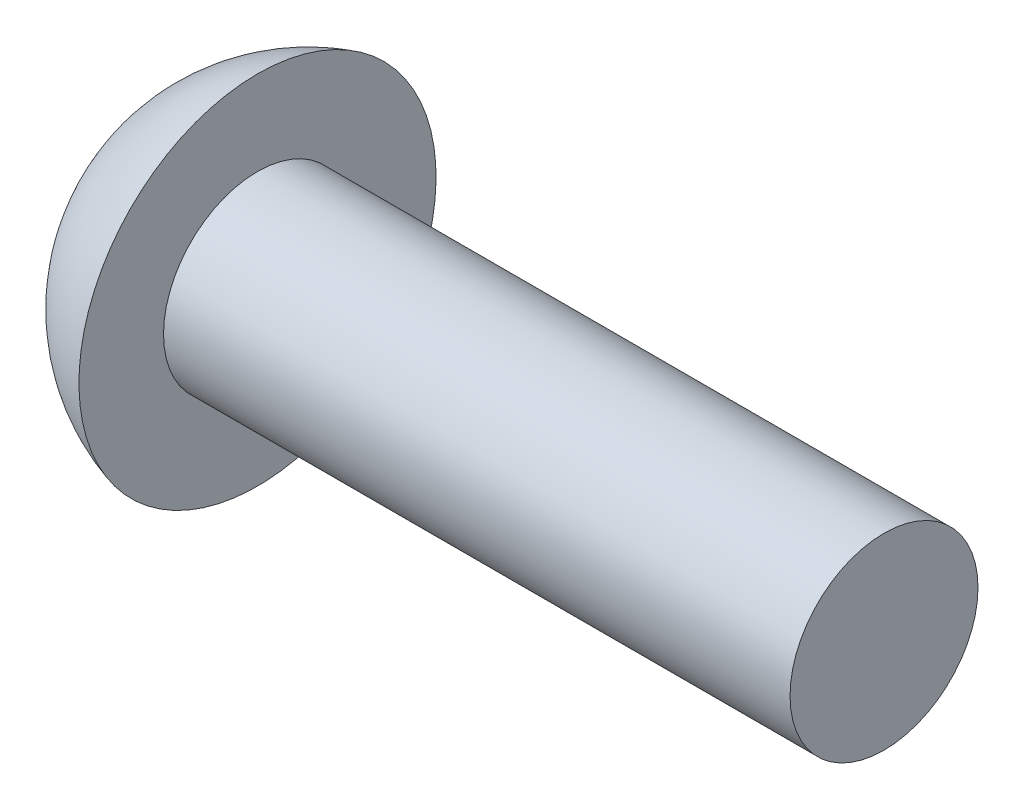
ISO-10303-21;
HEADER;
FILE_DESCRIPTION(('STEP AP214'),'2;1');
FILE_NAME('part.step','',(''),(''),'','','');
FILE_SCHEMA(('AUTOMOTIVE_DESIGN { 1 0 10303 214 1 1 1 1 }'));
ENDSEC;
DATA;
#1=APPLICATION_CONTEXT('core data for automotive mechanical design processes');
#2=APPLICATION_PROTOCOL_DEFINITION('international standard','automotive_design',2000,#1);
#3=PRODUCT_CONTEXT('',#1,'mechanical');
#4=PRODUCT('Part','Part','',(#3));
#5=PRODUCT_RELATED_PRODUCT_CATEGORY('part','',(#4));
#6=PRODUCT_DEFINITION_FORMATION('','',#4);
#7=PRODUCT_DEFINITION_CONTEXT('part definition',#1,'design');
#8=PRODUCT_DEFINITION('design','',#6,#7);
#9=PRODUCT_DEFINITION_SHAPE('','',#8);
#10=(LENGTH_UNIT() NAMED_UNIT(*) SI_UNIT(.MILLI.,.METRE.));
#11=(NAMED_UNIT(*) PLANE_ANGLE_UNIT() SI_UNIT($,.RADIAN.));
#12=(NAMED_UNIT(*) SI_UNIT($,.STERADIAN.) SOLID_ANGLE_UNIT());
#13=UNCERTAINTY_MEASURE_WITH_UNIT(LENGTH_MEASURE(1.E-05),#10,'distance_accuracy_value','');
#14=(GEOMETRIC_REPRESENTATION_CONTEXT(3) GLOBAL_UNCERTAINTY_ASSIGNED_CONTEXT((#13)) GLOBAL_UNIT_ASSIGNED_CONTEXT((#10,
#11,#12)) REPRESENTATION_CONTEXT('',''));
#15=CARTESIAN_POINT('',(0.,0.,0.));
#16=DIRECTION('',(0.,0.,1.));
#17=DIRECTION('',(1.,0.,0.));
#18=AXIS2_PLACEMENT_3D('',#15,#16,#17);
#19=CARTESIAN_POINT('',(0.,0.,0.));
#20=DIRECTION('',(1.,0.,0.));
#21=DIRECTION('',(0.,0.,-1.));
#22=AXIS2_PLACEMENT_3D('',#19,#20,#21);
#23=PLANE('',#22);
#24=CARTESIAN_POINT('',(0.,0.,0.));
#25=DIRECTION('',(-1.,0.,0.));
#26=DIRECTION('',(0.,0.,1.));
#27=AXIS2_PLACEMENT_3D('',#24,#25,#26);
#28=CIRCLE('',#27,1.65);
#29=CARTESIAN_POINT('',(0.,1.65,0.));
#30=VERTEX_POINT('',#29);
#31=EDGE_CURVE('E124',#30,#30,#28,.T.);
#32=ORIENTED_EDGE('',*,*,#31,.T.);
#33=EDGE_LOOP('',(#32));
#34=FACE_BOUND('',#33,.T.);
#35=DIRECTION('',(0.,0.866025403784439,-0.5));
#36=VECTOR('',#35,1.);
#37=CARTESIAN_POINT('',(0.,-1.,-0.57735026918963));
#38=LINE('',#37,#36);
#39=CARTESIAN_POINT('',(0.,-1.,-0.57735026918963));
#40=VERTEX_POINT('',#39);
#41=CARTESIAN_POINT('',(0.,0.,-1.15470053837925));
#42=VERTEX_POINT('',#41);
#43=EDGE_CURVE('E50',#40,#42,#38,.T.);
#44=ORIENTED_EDGE('',*,*,#43,.T.);
#45=DIRECTION('',(0.,0.866025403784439,0.5));
#46=VECTOR('',#45,1.);
#47=CARTESIAN_POINT('',(0.,0.,-1.15470053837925));
#48=LINE('',#47,#46);
#49=CARTESIAN_POINT('',(0.,1.,-0.577350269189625));
#50=VERTEX_POINT('',#49);
#51=EDGE_CURVE('E109',#42,#50,#48,.T.);
#52=ORIENTED_EDGE('',*,*,#51,.T.);
#53=DIRECTION('',(0.,0.,1.));
#54=VECTOR('',#53,1.);
#55=CARTESIAN_POINT('',(0.,1.,-0.577350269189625));
#56=LINE('',#55,#54);
#57=CARTESIAN_POINT('',(0.,1.,0.577350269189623));
#58=VERTEX_POINT('',#57);
#59=EDGE_CURVE('E107',#50,#58,#56,.T.);
#60=ORIENTED_EDGE('',*,*,#59,.T.);
#61=DIRECTION('',(0.,-0.866025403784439,0.5));
#62=VECTOR('',#61,1.);
#63=CARTESIAN_POINT('',(0.,1.,0.577350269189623));
#64=LINE('',#63,#62);
#65=CARTESIAN_POINT('',(0.,0.,1.15470053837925));
#66=VERTEX_POINT('',#65);
#67=EDGE_CURVE('E86',#58,#66,#64,.T.);
#68=ORIENTED_EDGE('',*,*,#67,.T.);
#69=DIRECTION('',(0.,-0.866025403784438,-0.5));
#70=VECTOR('',#69,1.);
#71=CARTESIAN_POINT('',(0.,0.,1.15470053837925));
#72=LINE('',#71,#70);
#73=CARTESIAN_POINT('',(0.,-1.,0.577350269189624));
#74=VERTEX_POINT('',#73);
#75=EDGE_CURVE('E97',#66,#74,#72,.T.);
#76=ORIENTED_EDGE('',*,*,#75,.T.);
#77=DIRECTION('',(0.,0.,-1.));
#78=VECTOR('',#77,1.);
#79=CARTESIAN_POINT('',(0.,-1.,0.577350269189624));
#80=LINE('',#79,#78);
#81=EDGE_CURVE('E103',#74,#40,#80,.T.);
#82=ORIENTED_EDGE('',*,*,#81,.T.);
#83=EDGE_LOOP('',(#44,#52,#60,#68,#76,#82));
#84=FACE_BOUND('',#83,.T.);
#85=ADVANCED_FACE('F36',(#34,#84),#23,.F.);
#86=CARTESIAN_POINT('',(1.65,0.,0.));
#87=DIRECTION('',(1.,0.,0.));
#88=DIRECTION('',(0.,0.,-1.));
#89=AXIS2_PLACEMENT_3D('',#86,#87,#88);
#90=PLANE('',#89);
#91=CARTESIAN_POINT('',(1.65,0.,0.));
#92=DIRECTION('',(-1.,0.,0.));
#93=DIRECTION('',(0.,0.,1.));
#94=AXIS2_PLACEMENT_3D('',#91,#92,#93);
#95=CIRCLE('',#94,2.85);
#96=CARTESIAN_POINT('',(1.65,2.85,0.));
#97=VERTEX_POINT('',#96);
#98=EDGE_CURVE('E43',#97,#97,#95,.T.);
#99=ORIENTED_EDGE('',*,*,#98,.F.);
#100=EDGE_LOOP('',(#99));
#101=FACE_BOUND('',#100,.T.);
#102=CARTESIAN_POINT('',(1.65,0.,0.));
#103=DIRECTION('',(1.,0.,0.));
#104=DIRECTION('',(0.,0.,-1.));
#105=AXIS2_PLACEMENT_3D('',#102,#103,#104);
#106=CIRCLE('',#105,1.5);
#107=CARTESIAN_POINT('',(1.65,0.,-1.5));
#108=VERTEX_POINT('',#107);
#109=EDGE_CURVE('E11',#108,#108,#106,.T.);
#110=ORIENTED_EDGE('',*,*,#109,.F.);
#111=EDGE_LOOP('',(#110));
#112=FACE_BOUND('',#111,.T.);
#113=ADVANCED_FACE('F135',(#101,#112),#90,.T.);
#114=CARTESIAN_POINT('',(9.65,0.,0.));
#115=DIRECTION('',(-1.,0.,0.));
#116=DIRECTION('',(0.,0.,1.));
#117=AXIS2_PLACEMENT_3D('',#114,#115,#116);
#118=CYLINDRICAL_SURFACE('',#117,1.5);
#119=ORIENTED_EDGE('',*,*,#109,.T.);
#120=EDGE_LOOP('',(#119));
#121=FACE_BOUND('',#120,.T.);
#122=CARTESIAN_POINT('',(11.65,0.,0.));
#123=DIRECTION('',(1.,0.,0.));
#124=DIRECTION('',(0.,0.,-1.));
#125=AXIS2_PLACEMENT_3D('',#122,#123,#124);
#126=CIRCLE('',#125,1.5);
#127=CARTESIAN_POINT('',(11.65,0.,-1.5));
#128=VERTEX_POINT('',#127);
#129=EDGE_CURVE('E146',#128,#128,#126,.T.);
#130=ORIENTED_EDGE('',*,*,#129,.F.);
#131=EDGE_LOOP('',(#130));
#132=FACE_BOUND('',#131,.T.);
#133=ADVANCED_FACE('F138',(#121,#132),#118,.T.);
#134=CARTESIAN_POINT('',(2.46136363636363,0.,0.));
#135=DIRECTION('',(-1.,0.,0.));
#136=DIRECTION('',(0.,1.,0.));
#137=AXIS2_PLACEMENT_3D('',#134,#135,#136);
#138=SPHERICAL_SURFACE('',#137,2.96324331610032);
#139=CARTESIAN_POINT('',(1.65,2.85,0.));
#140=CARTESIAN_POINT('',(1.6291329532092,2.84405942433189,0.));
#141=CARTESIAN_POINT('',(1.60833117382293,2.83788959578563,0.));
#142=CARTESIAN_POINT('',(1.56686813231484,2.82509458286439,0.));
#143=CARTESIAN_POINT('',(1.54620687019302,2.81846939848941,0.));
#144=CARTESIAN_POINT('',(1.50503484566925,2.80476682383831,0.));
#145=CARTESIAN_POINT('',(1.48452408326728,2.79768943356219,0.));
#146=CARTESIAN_POINT('',(1.44366294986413,2.78308587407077,0.));
#147=CARTESIAN_POINT('',(1.42331257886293,2.77555970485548,0.));
#148=CARTESIAN_POINT('',(1.38278204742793,2.7600622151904,0.));
#149=CARTESIAN_POINT('',(1.36260188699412,2.75209089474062,0.));
#150=CARTESIAN_POINT('',(1.32242151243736,2.73570694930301,0.));
#151=CARTESIAN_POINT('',(1.30242129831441,2.72729432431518,0.));
#152=CARTESIAN_POINT('',(1.26261046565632,2.71003182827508,0.));
#153=CARTESIAN_POINT('',(1.24279984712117,2.70118195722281,0.));
#154=CARTESIAN_POINT('',(1.20337776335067,2.68304923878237,0.));
#155=CARTESIAN_POINT('',(1.1837662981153,2.67376639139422,0.));
#156=CARTESIAN_POINT('',(1.1447519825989,2.65477219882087,0.));
#157=CARTESIAN_POINT('',(1.12534913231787,2.64506085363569,0.));
#158=CARTESIAN_POINT('',(1.08676140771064,2.62521435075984,0.));
#159=CARTESIAN_POINT('',(1.06757653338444,2.61507919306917,0.));
#160=CARTESIAN_POINT('',(1.02943401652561,2.59438995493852,0.));
#161=CARTESIAN_POINT('',(1.01047637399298,2.58383587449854,0.));
#162=CARTESIAN_POINT('',(0.972797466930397,2.56231388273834,0.));
#163=CARTESIAN_POINT('',(0.95407620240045,2.55134597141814,0.));
#164=CARTESIAN_POINT('',(0.916879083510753,2.52900160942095,0.));
#165=CARTESIAN_POINT('',(0.898403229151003,2.51762515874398,0.));
#166=CARTESIAN_POINT('',(0.861705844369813,2.49446920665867,0.));
#167=CARTESIAN_POINT('',(0.843484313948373,2.48268970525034,0.));
#168=CARTESIAN_POINT('',(0.807304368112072,2.45873333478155,0.));
#169=CARTESIAN_POINT('',(0.789345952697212,2.44655646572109,0.));
#170=CARTESIAN_POINT('',(0.75370090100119,2.42181123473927,0.));
#171=CARTESIAN_POINT('',(0.736014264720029,2.40924287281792,0.));
#172=CARTESIAN_POINT('',(0.700921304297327,2.38372071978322,0.));
#173=CARTESIAN_POINT('',(0.683514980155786,2.37076692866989,0.));
#174=CARTESIAN_POINT('',(0.648991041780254,2.3444801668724,0.));
#175=CARTESIAN_POINT('',(0.631873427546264,2.33114719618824,0.));
#176=CARTESIAN_POINT('',(0.59793516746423,2.30410850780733,0.));
#177=CARTESIAN_POINT('',(0.581114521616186,2.29040279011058,0.));
#178=CARTESIAN_POINT('',(0.547778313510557,2.26262522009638,0.));
#179=CARTESIAN_POINT('',(0.53126275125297,2.24855336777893,0.));
#180=CARTESIAN_POINT('',(0.49854467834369,2.22005031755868,0.));
#181=CARTESIAN_POINT('',(0.482342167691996,2.20561911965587,0.));
#182=CARTESIAN_POINT('',(0.450258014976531,2.17640434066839,0.));
#183=CARTESIAN_POINT('',(0.43437637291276,2.16162075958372,0.));
#184=CARTESIAN_POINT('',(0.402941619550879,2.13170834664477,0.));
#185=CARTESIAN_POINT('',(0.387388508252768,2.11657951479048,0.));
#186=CARTESIAN_POINT('',(0.356618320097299,2.08598389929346,0.));
#187=CARTESIAN_POINT('',(0.341401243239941,2.07051711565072,0.));
#188=CARTESIAN_POINT('',(0.311310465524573,2.03925305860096,0.));
#189=CARTESIAN_POINT('',(0.296436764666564,2.02345578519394,0.));
#190=CARTESIAN_POINT('',(0.267039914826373,1.99153837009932,0.));
#191=CARTESIAN_POINT('',(0.252516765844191,1.97541822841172,0.));
#192=CARTESIAN_POINT('',(0.223828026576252,1.94286285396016,0.));
#193=CARTESIAN_POINT('',(0.209662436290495,1.9264276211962,0.));
#194=CARTESIAN_POINT('',(0.1816956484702,1.89324999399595,0.));
#195=CARTESIAN_POINT('',(0.167894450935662,1.87650759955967,0.));
#196=CARTESIAN_POINT('',(0.14066310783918,1.84272372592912,0.));
#197=CARTESIAN_POINT('',(0.127232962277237,1.82568224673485,0.));
#198=CARTESIAN_POINT('',(0.100750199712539,1.79130842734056,0.));
#199=CARTESIAN_POINT('',(0.0876975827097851,1.77397608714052,0.));
#200=CARTESIAN_POINT('',(0.0619761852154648,1.73902890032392,0.));
#201=CARTESIAN_POINT('',(0.0493074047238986,1.72141405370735,0.));
#202=CARTESIAN_POINT('',(0.0243597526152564,1.68591038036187,0.));
#203=CARTESIAN_POINT('',(0.0120808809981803,1.66802155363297,0.));
#204=CARTESIAN_POINT('',(0.,1.65,0.));
#205=B_SPLINE_CURVE_WITH_KNOTS('',3,(#139,#140,#141,#142,#143,#144,#145,#146,#147,#148,#149,
#150,#151,#152,#153,#154,#155,#156,#157,#158,#159,#160,#161,#162,#163,#164,#165,#166,#167,#168,
#169,#170,#171,#172,#173,#174,#175,#176,#177,#178,#179,#180,#181,#182,#183,#184,#185,#186,#187,
#188,#189,#190,#191,#192,#193,#194,#195,#196,#197,#198,#199,#200,#201,#202,#203,#204),
.UNSPECIFIED.,.F.,.F.,(4,2,2,2,2,2,2,2,2,2,2,2,2,2,2,2,2,2,2,2,2,2,2,2,2,2,2,2,2,2,2,2,4),(0.,
0.0650872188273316,0.130174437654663,0.195261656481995,0.260348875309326,0.325436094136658,
0.390523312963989,0.455610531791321,0.520697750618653,0.585784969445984,0.650872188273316,
0.715959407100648,0.781046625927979,0.846133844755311,0.911221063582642,0.976308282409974,
1.04139550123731,1.10648272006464,1.17156993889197,1.2366571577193,1.30174437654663,
1.36683159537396,1.4319188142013,1.49700603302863,1.56209325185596,1.62718047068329,
1.69226768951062,1.75735490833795,1.82244212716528,1.88752934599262,1.95261656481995,
2.01770378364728,2.08279100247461),.UNSPECIFIED.);
#206=EDGE_CURVE('BSEAM132',#97,#30,#205,.T.);
#207=ORIENTED_EDGE('',*,*,#98,.T.);
#208=ORIENTED_EDGE('',*,*,#31,.F.);
#209=ORIENTED_EDGE('',*,*,#206,.T.);
#210=ORIENTED_EDGE('',*,*,#206,.F.);
#211=EDGE_LOOP('',(#207,#209,#208,#210));
#212=FACE_BOUND('',#211,.T.);
#213=ADVANCED_FACE('F132',(#212),#138,.T.);
#214=CARTESIAN_POINT('',(1.04,-1.,-0.57735026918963));
#215=DIRECTION('',(0.,0.5,0.866025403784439));
#216=DIRECTION('',(0.,-0.866025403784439,0.5));
#217=AXIS2_PLACEMENT_3D('',#214,#215,#216);
#218=PLANE('',#217);
#219=ORIENTED_EDGE('',*,*,#43,.F.);
#220=DIRECTION('',(-1.,0.,0.));
#221=VECTOR('',#220,1.);
#222=CARTESIAN_POINT('',(1.04,-1.,-0.57735026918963));
#223=LINE('',#222,#221);
#224=CARTESIAN_POINT('',(1.04,-1.,-0.57735026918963));
#225=VERTEX_POINT('',#224);
#226=EDGE_CURVE('E115',#225,#40,#223,.T.);
#227=ORIENTED_EDGE('',*,*,#226,.F.);
#228=DIRECTION('',(0.,0.866025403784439,-0.5));
#229=VECTOR('',#228,1.);
#230=CARTESIAN_POINT('',(1.04,-1.,-0.57735026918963));
#231=LINE('',#230,#229);
#232=CARTESIAN_POINT('',(1.04,0.,-1.15470053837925));
#233=VERTEX_POINT('',#232);
#234=EDGE_CURVE('E114',#225,#233,#231,.T.);
#235=ORIENTED_EDGE('',*,*,#234,.T.);
#236=DIRECTION('',(-1.,0.,0.));
#237=VECTOR('',#236,1.);
#238=CARTESIAN_POINT('',(1.04,0.,-1.15470053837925));
#239=LINE('',#238,#237);
#240=EDGE_CURVE('E122',#233,#42,#239,.T.);
#241=ORIENTED_EDGE('',*,*,#240,.T.);
#242=EDGE_LOOP('',(#219,#227,#235,#241));
#243=FACE_BOUND('',#242,.T.);
#244=ADVANCED_FACE('F182',(#243),#218,.T.);
#245=CARTESIAN_POINT('',(1.04,0.,-1.15470053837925));
#246=DIRECTION('',(0.,-0.5,0.866025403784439));
#247=DIRECTION('',(0.,-0.866025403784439,-0.5));
#248=AXIS2_PLACEMENT_3D('',#245,#246,#247);
#249=PLANE('',#248);
#250=ORIENTED_EDGE('',*,*,#51,.F.);
#251=ORIENTED_EDGE('',*,*,#240,.F.);
#252=DIRECTION('',(0.,0.866025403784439,0.5));
#253=VECTOR('',#252,1.);
#254=CARTESIAN_POINT('',(1.04,0.,-1.15470053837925));
#255=LINE('',#254,#253);
#256=CARTESIAN_POINT('',(1.04,1.,-0.577350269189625));
#257=VERTEX_POINT('',#256);
#258=EDGE_CURVE('E168',#233,#257,#255,.T.);
#259=ORIENTED_EDGE('',*,*,#258,.T.);
#260=DIRECTION('',(-1.,0.,0.));
#261=VECTOR('',#260,1.);
#262=CARTESIAN_POINT('',(1.04,1.,-0.577350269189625));
#263=LINE('',#262,#261);
#264=EDGE_CURVE('E120',#257,#50,#263,.T.);
#265=ORIENTED_EDGE('',*,*,#264,.T.);
#266=EDGE_LOOP('',(#250,#251,#259,#265));
#267=FACE_BOUND('',#266,.T.);
#268=ADVANCED_FACE('F179',(#267),#249,.T.);
#269=CARTESIAN_POINT('',(1.04,1.,-0.577350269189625));
#270=DIRECTION('',(0.,-1.,0.));
#271=DIRECTION('',(0.,0.,-1.));
#272=AXIS2_PLACEMENT_3D('',#269,#270,#271);
#273=PLANE('',#272);
#274=ORIENTED_EDGE('',*,*,#59,.F.);
#275=ORIENTED_EDGE('',*,*,#264,.F.);
#276=DIRECTION('',(0.,0.,1.));
#277=VECTOR('',#276,1.);
#278=CARTESIAN_POINT('',(1.04,1.,-0.577350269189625));
#279=LINE('',#278,#277);
#280=CARTESIAN_POINT('',(1.04,1.,0.577350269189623));
#281=VERTEX_POINT('',#280);
#282=EDGE_CURVE('E59',#257,#281,#279,.T.);
#283=ORIENTED_EDGE('',*,*,#282,.T.);
#284=DIRECTION('',(-1.,0.,0.));
#285=VECTOR('',#284,1.);
#286=CARTESIAN_POINT('',(1.04,1.,0.577350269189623));
#287=LINE('',#286,#285);
#288=EDGE_CURVE('E93',#281,#58,#287,.T.);
#289=ORIENTED_EDGE('',*,*,#288,.T.);
#290=EDGE_LOOP('',(#274,#275,#283,#289));
#291=FACE_BOUND('',#290,.T.);
#292=ADVANCED_FACE('F211',(#291),#273,.T.);
#293=CARTESIAN_POINT('',(1.04,1.,0.577350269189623));
#294=DIRECTION('',(0.,-0.5,-0.866025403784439));
#295=DIRECTION('',(0.,0.866025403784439,-0.5));
#296=AXIS2_PLACEMENT_3D('',#293,#294,#295);
#297=PLANE('',#296);
#298=ORIENTED_EDGE('',*,*,#67,.F.);
#299=ORIENTED_EDGE('',*,*,#288,.F.);
#300=DIRECTION('',(0.,-0.866025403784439,0.5));
#301=VECTOR('',#300,1.);
#302=CARTESIAN_POINT('',(1.04,1.,0.577350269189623));
#303=LINE('',#302,#301);
#304=CARTESIAN_POINT('',(1.04,0.,1.15470053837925));
#305=VERTEX_POINT('',#304);
#306=EDGE_CURVE('E90',#281,#305,#303,.T.);
#307=ORIENTED_EDGE('',*,*,#306,.T.);
#308=DIRECTION('',(-1.,0.,0.));
#309=VECTOR('',#308,1.);
#310=CARTESIAN_POINT('',(1.04,0.,1.15470053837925));
#311=LINE('',#310,#309);
#312=EDGE_CURVE('E81',#305,#66,#311,.T.);
#313=ORIENTED_EDGE('',*,*,#312,.T.);
#314=EDGE_LOOP('',(#298,#299,#307,#313));
#315=FACE_BOUND('',#314,.T.);
#316=ADVANCED_FACE('F83',(#315),#297,.T.);
#317=CARTESIAN_POINT('',(1.04,0.,1.15470053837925));
#318=DIRECTION('',(0.,0.5,-0.866025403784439));
#319=DIRECTION('',(0.,0.866025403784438,0.5));
#320=AXIS2_PLACEMENT_3D('',#317,#318,#319);
#321=PLANE('',#320);
#322=ORIENTED_EDGE('',*,*,#75,.F.);
#323=ORIENTED_EDGE('',*,*,#312,.F.);
#324=DIRECTION('',(0.,-0.866025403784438,-0.5));
#325=VECTOR('',#324,1.);
#326=CARTESIAN_POINT('',(1.04,0.,1.15470053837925));
#327=LINE('',#326,#325);
#328=CARTESIAN_POINT('',(1.04,-1.,0.577350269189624));
#329=VERTEX_POINT('',#328);
#330=EDGE_CURVE('E173',#305,#329,#327,.T.);
#331=ORIENTED_EDGE('',*,*,#330,.T.);
#332=DIRECTION('',(-1.,0.,0.));
#333=VECTOR('',#332,1.);
#334=CARTESIAN_POINT('',(1.04,-1.,0.577350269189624));
#335=LINE('',#334,#333);
#336=EDGE_CURVE('E94',#329,#74,#335,.T.);
#337=ORIENTED_EDGE('',*,*,#336,.T.);
#338=EDGE_LOOP('',(#322,#323,#331,#337));
#339=FACE_BOUND('',#338,.T.);
#340=ADVANCED_FACE('F98',(#339),#321,.T.);
#341=CARTESIAN_POINT('',(1.04,-1.,0.577350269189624));
#342=DIRECTION('',(0.,1.,0.));
#343=DIRECTION('',(0.,0.,1.));
#344=AXIS2_PLACEMENT_3D('',#341,#342,#343);
#345=PLANE('',#344);
#346=ORIENTED_EDGE('',*,*,#81,.F.);
#347=ORIENTED_EDGE('',*,*,#336,.F.);
#348=DIRECTION('',(0.,0.,-1.));
#349=VECTOR('',#348,1.);
#350=CARTESIAN_POINT('',(1.04,-1.,0.577350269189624));
#351=LINE('',#350,#349);
#352=EDGE_CURVE('E117',#329,#225,#351,.T.);
#353=ORIENTED_EDGE('',*,*,#352,.T.);
#354=ORIENTED_EDGE('',*,*,#226,.T.);
#355=EDGE_LOOP('',(#346,#347,#353,#354));
#356=FACE_BOUND('',#355,.T.);
#357=ADVANCED_FACE('F196',(#356),#345,.T.);
#358=CARTESIAN_POINT('',(1.04,0.,1.15470053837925));
#359=DIRECTION('',(0.86602540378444,-0.25,0.433012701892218));
#360=DIRECTION('',(0.447213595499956,0.,-0.894427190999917));
#361=AXIS2_PLACEMENT_3D('',#358,#359,#360);
#362=PLANE('',#361);
#363=ORIENTED_EDGE('',*,*,#330,.F.);
#364=DIRECTION('',(-0.447213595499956,0.,0.894427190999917));
#365=VECTOR('',#364,1.);
#366=CARTESIAN_POINT('',(1.04,0.,1.15470053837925));
#367=LINE('',#366,#365);
#368=CARTESIAN_POINT('',(1.61735026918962,0.,0.));
#369=VERTEX_POINT('',#368);
#370=EDGE_CURVE('E148',#369,#305,#367,.T.);
#371=ORIENTED_EDGE('',*,*,#370,.F.);
#372=DIRECTION('',(-0.447213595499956,-0.774596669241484,0.447213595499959));
#373=VECTOR('',#372,1.);
#374=CARTESIAN_POINT('',(1.04,-1.,0.577350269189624));
#375=LINE('',#374,#373);
#376=EDGE_CURVE('E154',#369,#329,#375,.T.);
#377=ORIENTED_EDGE('',*,*,#376,.T.);
#378=EDGE_LOOP('',(#363,#371,#377));
#379=FACE_BOUND('',#378,.T.);
#380=ADVANCED_FACE('F203',(#379),#362,.F.);
#381=CARTESIAN_POINT('',(1.04,-1.,0.577350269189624));
#382=DIRECTION('',(0.86602540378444,-0.5,0.));
#383=DIRECTION('',(0.5,0.86602540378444,0.));
#384=AXIS2_PLACEMENT_3D('',#381,#382,#383);
#385=PLANE('',#384);
#386=ORIENTED_EDGE('',*,*,#352,.F.);
#387=ORIENTED_EDGE('',*,*,#376,.F.);
#388=DIRECTION('',(-0.447213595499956,-0.774596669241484,-0.447213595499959));
#389=VECTOR('',#388,1.);
#390=CARTESIAN_POINT('',(1.04,-1.,-0.57735026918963));
#391=LINE('',#390,#389);
#392=EDGE_CURVE('E156',#369,#225,#391,.T.);
#393=ORIENTED_EDGE('',*,*,#392,.T.);
#394=EDGE_LOOP('',(#386,#387,#393));
#395=FACE_BOUND('',#394,.T.);
#396=ADVANCED_FACE('F199',(#395),#385,.F.);
#397=CARTESIAN_POINT('',(1.04,-1.,-0.57735026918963));
#398=DIRECTION('',(0.86602540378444,-0.25,-0.433012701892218));
#399=DIRECTION('',(-0.447213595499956,0.,-0.894427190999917));
#400=AXIS2_PLACEMENT_3D('',#397,#398,#399);
#401=PLANE('',#400);
#402=ORIENTED_EDGE('',*,*,#234,.F.);
#403=ORIENTED_EDGE('',*,*,#392,.F.);
#404=DIRECTION('',(-0.447213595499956,0.,-0.894427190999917));
#405=VECTOR('',#404,1.);
#406=CARTESIAN_POINT('',(1.04,0.,-1.15470053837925));
#407=LINE('',#406,#405);
#408=EDGE_CURVE('E161',#369,#233,#407,.T.);
#409=ORIENTED_EDGE('',*,*,#408,.T.);
#410=EDGE_LOOP('',(#402,#403,#409));
#411=FACE_BOUND('',#410,.T.);
#412=ADVANCED_FACE('F189',(#411),#401,.F.);
#413=CARTESIAN_POINT('',(1.04,0.,-1.15470053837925));
#414=DIRECTION('',(0.86602540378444,0.25,-0.433012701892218));
#415=DIRECTION('',(-0.447213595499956,0.,-0.894427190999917));
#416=AXIS2_PLACEMENT_3D('',#413,#414,#415);
#417=PLANE('',#416);
#418=ORIENTED_EDGE('',*,*,#258,.F.);
#419=ORIENTED_EDGE('',*,*,#408,.F.);
#420=DIRECTION('',(-0.447213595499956,0.774596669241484,-0.447213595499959));
#421=VECTOR('',#420,1.);
#422=CARTESIAN_POINT('',(1.04,1.,-0.577350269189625));
#423=LINE('',#422,#421);
#424=EDGE_CURVE('E159',#369,#257,#423,.T.);
#425=ORIENTED_EDGE('',*,*,#424,.T.);
#426=EDGE_LOOP('',(#418,#419,#425));
#427=FACE_BOUND('',#426,.T.);
#428=ADVANCED_FACE('F281',(#427),#417,.F.);
#429=CARTESIAN_POINT('',(1.04,1.,-0.577350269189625));
#430=DIRECTION('',(0.86602540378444,0.5,0.));
#431=DIRECTION('',(-0.5,0.86602540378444,0.));
#432=AXIS2_PLACEMENT_3D('',#429,#430,#431);
#433=PLANE('',#432);
#434=ORIENTED_EDGE('',*,*,#282,.F.);
#435=ORIENTED_EDGE('',*,*,#424,.F.);
#436=DIRECTION('',(-0.447213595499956,0.774596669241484,0.447213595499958));
#437=VECTOR('',#436,1.);
#438=CARTESIAN_POINT('',(1.04,1.,0.577350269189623));
#439=LINE('',#438,#437);
#440=EDGE_CURVE('E151',#369,#281,#439,.T.);
#441=ORIENTED_EDGE('',*,*,#440,.T.);
#442=EDGE_LOOP('',(#434,#435,#441));
#443=FACE_BOUND('',#442,.T.);
#444=ADVANCED_FACE('F208',(#443),#433,.F.);
#445=CARTESIAN_POINT('',(1.04,1.,0.577350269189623));
#446=DIRECTION('',(0.86602540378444,0.25,0.433012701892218));
#447=DIRECTION('',(0.447213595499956,0.,-0.894427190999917));
#448=AXIS2_PLACEMENT_3D('',#445,#446,#447);
#449=PLANE('',#448);
#450=ORIENTED_EDGE('',*,*,#306,.F.);
#451=ORIENTED_EDGE('',*,*,#440,.F.);
#452=ORIENTED_EDGE('',*,*,#370,.T.);
#453=EDGE_LOOP('',(#450,#451,#452));
#454=FACE_BOUND('',#453,.T.);
#455=ADVANCED_FACE('F209',(#454),#449,.F.);
#456=CARTESIAN_POINT('',(11.65,0.,0.));
#457=DIRECTION('',(1.,0.,0.));
#458=DIRECTION('',(0.,0.,-1.));
#459=AXIS2_PLACEMENT_3D('',#456,#457,#458);
#460=PLANE('',#459);
#461=ORIENTED_EDGE('',*,*,#129,.T.);
#462=EDGE_LOOP('',(#461));
#463=FACE_BOUND('',#462,.T.);
#464=ADVANCED_FACE('F307',(#463),#460,.T.);
#465=CLOSED_SHELL('',(#85,#113,#133,#213,#244,#268,#292,#316,#340,#357,#380,#396,#412,#428,#444,
#455,#464));
#466=MANIFOLD_SOLID_BREP('B2',#465);
#467=ADVANCED_BREP_SHAPE_REPRESENTATION('',(#18,#466),#14);
#468=SHAPE_DEFINITION_REPRESENTATION(#9,#467);
ENDSEC;
END-ISO-10303-21;
